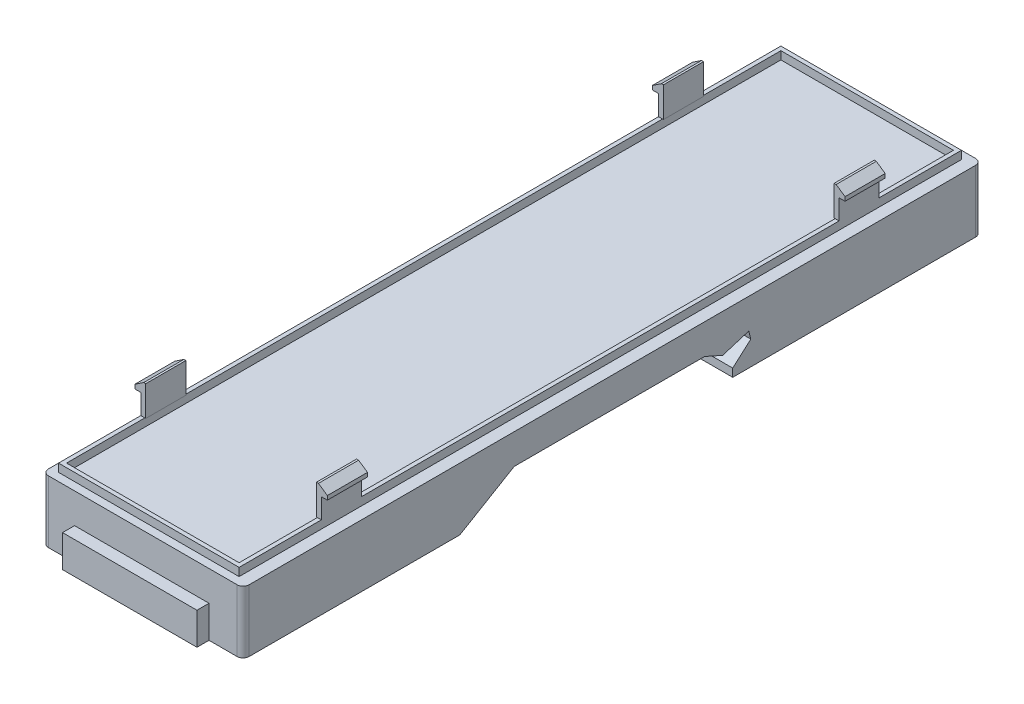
from build123d import *

# Parameters (mm, degrees)
AUFSATZ_LINEAR_AUSTRAGEN2_DEPTH  = 25
SKIZZE2_W                        = 16.75
SKIZZE2_H                        = 4
AUFSATZ_LINEAR_AUSTRAGEN3_DEPTH  = 1.5
VERRUNDUNG1_R                    = 0.75
SKIZZE3_W                        = 22.5
SKIZZE3_H                        = 90
SKIZZE3_W_2                      = 21.5
SKIZZE3_H_2                      = 89
AUFSATZ_LINEAR_AUSTRAGEN4_DEPTH  = 1
AUFSATZ_LINEAR_START             = -10.25
AUFSATZ_LINEAR_AUSTRAGEN11_DEPTH = 5
LINEARES_MUSTER3_COUNT           = 2
LINEARES_MUSTER3_PITCH           = 64.5


with BuildPart() as part:
    # Skizze1 → Aufsatz-Linear austragen2 (new body)
    with BuildSketch(Plane(origin=(0, 0, 0), x_dir=(0, 0, -1), z_dir=(1, 0, 0))):
        Polygon((-19.5, 0), (-46.5, 0), (-46.5, 7.75), (45.5, 7.75), (45.5, 0), (14.5, 0), (14.5, 1), (16.75, 3), (16.5, 4), (13.25, 3), (11, 4), (-12.724056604, 4), align=None)
    extrude(amount=AUFSATZ_LINEAR_AUSTRAGEN2_DEPTH)

    # Skizze2 → Aufsatz-Linear austragen3 (add)
    with BuildSketch(Plane.XY.offset(46.5)):
        with Locations((12.375, 2)):
            Rectangle(SKIZZE2_W, SKIZZE2_H)
    extrude(amount=AUFSATZ_LINEAR_AUSTRAGEN3_DEPTH)

    # Verrundung1
    verrundung1_edges = [part.edges().sort_by_distance(p)[0] for p in [
        (0, 3.875, 46.5),
        (0, 3.875, -45.5),
        (25, 3.875, -45.5),
        (25, 3.875, 46.5),
    ]]
    fillet(verrundung1_edges, radius=VERRUNDUNG1_R)

    # Skizze3 → Aufsatz-Linear austragen4 (add)
    with BuildSketch(Plane(origin=(0, 7.75, 0), x_dir=(1, 0, 0), z_dir=(0, 1, 0))):
        with Locations((12.25, -0.5)):
            Rectangle(SKIZZE3_W, SKIZZE3_H)
        with Locations((12.25, -0.5)):
            Rectangle(SKIZZE3_W_2, SKIZZE3_H_2, mode=Mode.SUBTRACT)
    extrude(amount=AUFSATZ_LINEAR_AUSTRAGEN4_DEPTH)

    # Skizze4 → Aufsatz-Linear austragen11 (add)
    with BuildSketch(Plane.XY.offset(45.5).offset(AUFSATZ_LINEAR_START)):
        Polygon((22.881966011, 12.5), (22.881966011, 8.75), (23.5, 8.75), (23.5, 11.25), (24.25, 11.25), (24.25, 11.75), (23.131966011, 12.5), align=None)
        Polygon((1, 11.25), (1, 8.75), (1.618033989, 8.75), (1.618033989, 12.5), (1.368033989, 12.5), (0.25, 11.75), (0.25, 11.25), align=None)
    aufsatz_linear_austragen11 = extrude(amount=-AUFSATZ_LINEAR_AUSTRAGEN11_DEPTH)

    # Lineares Muster3: Aufsatz-Linear austragen11 ×2
    with Locations(*[(0, 0, -i * LINEARES_MUSTER3_PITCH) for i in range(1, LINEARES_MUSTER3_COUNT)]):
        add(aufsatz_linear_austragen11)


solid = part.part
